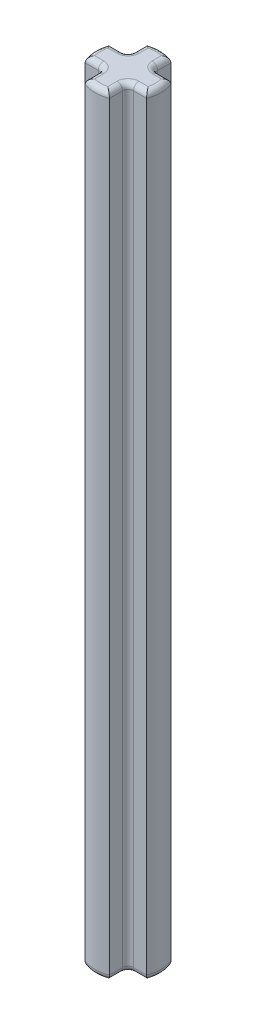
from build123d import *

# Parameters (mm, degrees)
SKETCH_1_W          = 2.4
SKETCH_1_H          = 56
CUT_EXTRUDE_1_DEPTH = 57.102762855
CUT_EXTRUDE_2_DEPTH = 57.102762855
CUT_EXTRUDE_3_DEPTH = 57.102762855
CUT_EXTRUDE_4_DEPTH = 57.102762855
FILLET_1_R          = 0.4


with BuildPart() as part:
    # Sketch 1 → Revolve 1 (revolve)
    with BuildSketch(Plane.XY):
        with Locations((1.2, 28)):
            Rectangle(SKETCH_1_W, SKETCH_1_H)
    revolve(axis=Axis((0, 56, 0), (0, -1, 0)))

    # Sketch 2 → Cut-Extrude 1 (cut, through all)
    with BuildSketch(Plane(origin=(0, 56, 0), x_dir=(-1, 0, 0), z_dir=(0, 1, 0))):
        with BuildLine():
            Line((0.88, 2.232845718), (0.88, 0.88))
            Line((0.88, 0.88), (2.232845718, 0.88))
            ThreePointArc((2.232845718, 0.88), (1.697056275, 1.697056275), (0.88, 2.232845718))
        make_face()
    extrude(amount=-CUT_EXTRUDE_1_DEPTH, mode=Mode.SUBTRACT)

    # Sketch 3 → Cut-Extrude 2 (cut, through all)
    with BuildSketch(Plane(origin=(0, 56, 0), x_dir=(-1, 0, 0), z_dir=(0, 1, 0))):
        with BuildLine():
            Line((2.232845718, -0.88), (0.88, -0.88))
            Line((0.88, -0.88), (0.88, -2.232845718))
            ThreePointArc((0.88, -2.232845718), (1.697056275, -1.697056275), (2.232845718, -0.88))
        make_face()
    extrude(amount=-CUT_EXTRUDE_2_DEPTH, mode=Mode.SUBTRACT)

    # Sketch 4 → Cut-Extrude 3 (cut, through all)
    with BuildSketch(Plane(origin=(0, 56, 0), x_dir=(-1, 0, 0), z_dir=(0, 1, 0))):
        with BuildLine():
            Line((-0.88, -2.232845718), (-0.88, -0.88))
            Line((-0.88, -0.88), (-2.232845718, -0.88))
            ThreePointArc((-2.232845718, -0.88), (-1.697056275, -1.697056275), (-0.88, -2.232845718))
        make_face()
    extrude(amount=-CUT_EXTRUDE_3_DEPTH, mode=Mode.SUBTRACT)

    # Sketch 5 → Cut-Extrude 4 (cut, through all)
    with BuildSketch(Plane(origin=(0, 56, 0), x_dir=(-1, 0, 0), z_dir=(0, 1, 0))):
        with BuildLine():
            Line((-2.232845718, 0.88), (-0.88, 0.88))
            Line((-0.88, 0.88), (-0.88, 2.232845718))
            ThreePointArc((-0.88, 2.232845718), (-1.697056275, 1.697056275), (-2.232845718, 0.88))
        make_face()
    extrude(amount=-CUT_EXTRUDE_4_DEPTH, mode=Mode.SUBTRACT)

    # Fillet 1
    fillet_1_edges = [part.edges().sort_by_distance(p)[0] for p in [
        (-2.4, 56, 0),
        (-1.556422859, 0, 0.88),
        (-0.88, 0, 1.556422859),
        (-0.88, 28, 0.88),
        (-0.88, 56, 1.556422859),
        (-1.556422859, 56, 0.88),
        (0, 0, -2.4),
        (0, 56, -2.4),
        (-0.88, 0, -1.556422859),
        (-1.556422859, 0, -0.88),
        (-0.88, 28, -0.88),
        (-1.556422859, 56, -0.88),
        (-0.88, 56, -1.556422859),
        (2.4, 0, 0),
        (2.4, 56, 0),
        (1.556422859, 0, -0.88),
        (0.88, 0, -1.556422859),
        (0.88, 28, -0.88),
        (0.88, 56, -1.556422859),
        (1.556422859, 56, -0.88),
        (0, 0, 2.4),
        (0, 56, 2.4),
        (0.88, 0, 1.556422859),
        (1.556422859, 0, 0.88),
        (0.88, 28, 0.88),
        (1.556422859, 56, 0.88),
        (0.88, 56, 1.556422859),
        (-2.4, 0, 0),
    ]]
    fillet(fillet_1_edges, radius=FILLET_1_R)


solid = part.part
